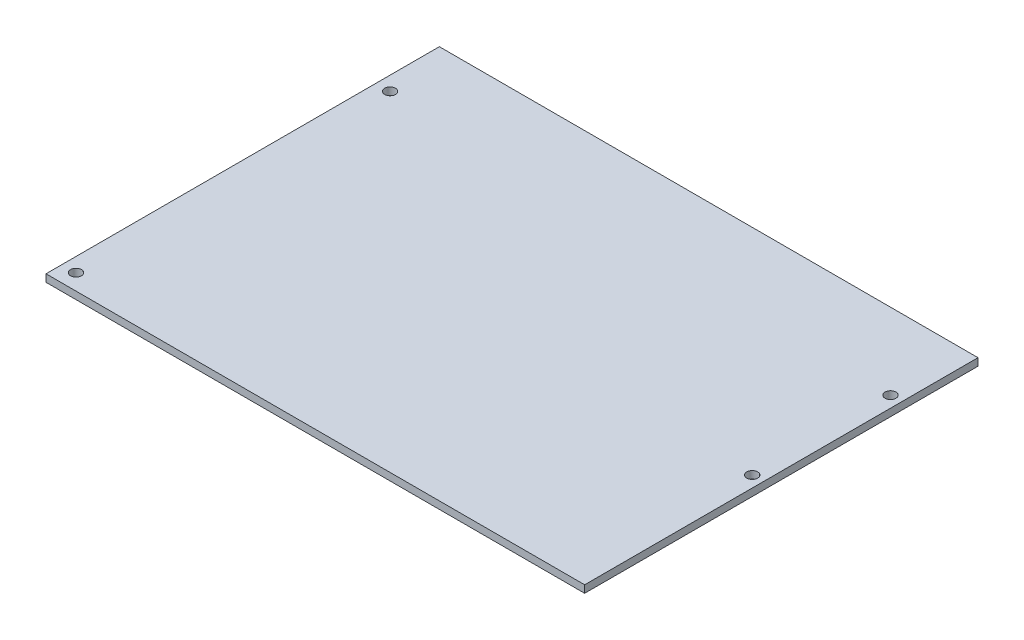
ISO-10303-21;
HEADER;
FILE_DESCRIPTION(('STEP AP214'),'2;1');
FILE_NAME('part.step','',(''),(''),'','','');
FILE_SCHEMA(('AUTOMOTIVE_DESIGN { 1 0 10303 214 1 1 1 1 }'));
ENDSEC;
DATA;
#1=APPLICATION_CONTEXT('core data for automotive mechanical design processes');
#2=APPLICATION_PROTOCOL_DEFINITION('international standard','automotive_design',2000,#1);
#3=PRODUCT_CONTEXT('',#1,'mechanical');
#4=PRODUCT('Part','Part','',(#3));
#5=PRODUCT_RELATED_PRODUCT_CATEGORY('part','',(#4));
#6=PRODUCT_DEFINITION_FORMATION('','',#4);
#7=PRODUCT_DEFINITION_CONTEXT('part definition',#1,'design');
#8=PRODUCT_DEFINITION('design','',#6,#7);
#9=PRODUCT_DEFINITION_SHAPE('','',#8);
#10=(LENGTH_UNIT() NAMED_UNIT(*) SI_UNIT(.MILLI.,.METRE.));
#11=(NAMED_UNIT(*) PLANE_ANGLE_UNIT() SI_UNIT($,.RADIAN.));
#12=(NAMED_UNIT(*) SI_UNIT($,.STERADIAN.) SOLID_ANGLE_UNIT());
#13=UNCERTAINTY_MEASURE_WITH_UNIT(LENGTH_MEASURE(1.E-05),#10,'distance_accuracy_value','');
#14=(GEOMETRIC_REPRESENTATION_CONTEXT(3) GLOBAL_UNCERTAINTY_ASSIGNED_CONTEXT((#13)) GLOBAL_UNIT_ASSIGNED_CONTEXT((#10,
#11,#12)) REPRESENTATION_CONTEXT('',''));
#15=CARTESIAN_POINT('',(0.,0.,0.));
#16=DIRECTION('',(0.,0.,1.));
#17=DIRECTION('',(1.,0.,0.));
#18=AXIS2_PLACEMENT_3D('',#15,#16,#17);
#19=CARTESIAN_POINT('',(0.,2.0066,-106.5657));
#20=DIRECTION('',(0.,-1.,0.));
#21=DIRECTION('',(0.,0.,-1.));
#22=AXIS2_PLACEMENT_3D('',#19,#20,#21);
#23=PLANE('',#22);
#24=CARTESIAN_POINT('',(142.875,2.0066,-85.9155));
#25=DIRECTION('',(0.,1.,0.));
#26=DIRECTION('',(0.,0.,1.));
#27=AXIS2_PLACEMENT_3D('',#24,#25,#26);
#28=CIRCLE('',#27,1.4732);
#29=CARTESIAN_POINT('',(142.875,2.0066,-84.4423));
#30=VERTEX_POINT('',#29);
#31=EDGE_CURVE('E123',#30,#30,#28,.T.);
#32=ORIENTED_EDGE('',*,*,#31,.F.);
#33=EDGE_LOOP('',(#32));
#34=FACE_BOUND('',#33,.T.);
#35=CARTESIAN_POINT('',(3.81,2.0066,-89.408));
#36=DIRECTION('',(0.,1.,0.));
#37=DIRECTION('',(0.,0.,1.));
#38=AXIS2_PLACEMENT_3D('',#35,#36,#37);
#39=CIRCLE('',#38,1.4732);
#40=CARTESIAN_POINT('',(3.81,2.0066,-87.9348));
#41=VERTEX_POINT('',#40);
#42=EDGE_CURVE('E91',#41,#41,#39,.T.);
#43=ORIENTED_EDGE('',*,*,#42,.F.);
#44=EDGE_LOOP('',(#43));
#45=FACE_BOUND('',#44,.T.);
#46=DIRECTION('',(0.,0.,1.));
#47=VECTOR('',#46,1.);
#48=CARTESIAN_POINT('',(0.,2.0066,0.));
#49=LINE('',#48,#47);
#50=CARTESIAN_POINT('',(0.,2.0066,-106.5657));
#51=VERTEX_POINT('',#50);
#52=CARTESIAN_POINT('',(0.,2.0066,0.));
#53=VERTEX_POINT('',#52);
#54=EDGE_CURVE('E48',#51,#53,#49,.T.);
#55=ORIENTED_EDGE('',*,*,#54,.T.);
#56=DIRECTION('',(1.,0.,0.));
#57=VECTOR('',#56,1.);
#58=CARTESIAN_POINT('',(0.,2.0066,0.));
#59=LINE('',#58,#57);
#60=CARTESIAN_POINT('',(145.9357,2.0066,0.));
#61=VERTEX_POINT('',#60);
#62=EDGE_CURVE('E93',#53,#61,#59,.T.);
#63=ORIENTED_EDGE('',*,*,#62,.T.);
#64=DIRECTION('',(0.,0.,-1.));
#65=VECTOR('',#64,1.);
#66=CARTESIAN_POINT('',(145.9357,2.0066,0.));
#67=LINE('',#66,#65);
#68=CARTESIAN_POINT('',(145.9357,2.0066,-106.5657));
#69=VERTEX_POINT('',#68);
#70=EDGE_CURVE('E55',#61,#69,#67,.T.);
#71=ORIENTED_EDGE('',*,*,#70,.T.);
#72=DIRECTION('',(-1.,0.,0.));
#73=VECTOR('',#72,1.);
#74=CARTESIAN_POINT('',(0.,2.0066,-106.5657));
#75=LINE('',#74,#73);
#76=EDGE_CURVE('E97',#69,#51,#75,.T.);
#77=ORIENTED_EDGE('',*,*,#76,.T.);
#78=EDGE_LOOP('',(#55,#63,#71,#77));
#79=FACE_BOUND('',#78,.T.);
#80=CARTESIAN_POINT('',(3.81,2.0066,-4.318));
#81=DIRECTION('',(0.,1.,0.));
#82=DIRECTION('',(0.,0.,1.));
#83=AXIS2_PLACEMENT_3D('',#80,#81,#82);
#84=CIRCLE('',#83,1.4732);
#85=CARTESIAN_POINT('',(3.81,2.0066,-2.8448));
#86=VERTEX_POINT('',#85);
#87=EDGE_CURVE('E117',#86,#86,#84,.T.);
#88=ORIENTED_EDGE('',*,*,#87,.F.);
#89=EDGE_LOOP('',(#88));
#90=FACE_BOUND('',#89,.T.);
#91=CARTESIAN_POINT('',(142.875,2.0066,-48.4505));
#92=DIRECTION('',(0.,1.,0.));
#93=DIRECTION('',(0.,0.,1.));
#94=AXIS2_PLACEMENT_3D('',#91,#92,#93);
#95=CIRCLE('',#94,1.4732);
#96=CARTESIAN_POINT('',(142.875,2.0066,-46.9773));
#97=VERTEX_POINT('',#96);
#98=EDGE_CURVE('E129',#97,#97,#95,.T.);
#99=ORIENTED_EDGE('',*,*,#98,.F.);
#100=EDGE_LOOP('',(#99));
#101=FACE_BOUND('',#100,.T.);
#102=ADVANCED_FACE('F33',(#34,#45,#79,#90,#101),#23,.F.);
#103=CARTESIAN_POINT('',(0.,0.,-106.5657));
#104=DIRECTION('',(0.,-1.,0.));
#105=DIRECTION('',(0.,0.,-1.));
#106=AXIS2_PLACEMENT_3D('',#103,#104,#105);
#107=PLANE('',#106);
#108=CARTESIAN_POINT('',(142.875,0.,-85.9155));
#109=DIRECTION('',(0.,1.,0.));
#110=DIRECTION('',(0.,0.,1.));
#111=AXIS2_PLACEMENT_3D('',#108,#109,#110);
#112=CIRCLE('',#111,1.4732);
#113=CARTESIAN_POINT('',(142.875,0.,-84.4423));
#114=VERTEX_POINT('',#113);
#115=EDGE_CURVE('E126',#114,#114,#112,.T.);
#116=ORIENTED_EDGE('',*,*,#115,.T.);
#117=EDGE_LOOP('',(#116));
#118=FACE_BOUND('',#117,.T.);
#119=CARTESIAN_POINT('',(3.81,0.,-89.408));
#120=DIRECTION('',(0.,1.,0.));
#121=DIRECTION('',(0.,0.,1.));
#122=AXIS2_PLACEMENT_3D('',#119,#120,#121);
#123=CIRCLE('',#122,1.4732);
#124=CARTESIAN_POINT('',(3.81,0.,-87.9348));
#125=VERTEX_POINT('',#124);
#126=EDGE_CURVE('E114',#125,#125,#123,.T.);
#127=ORIENTED_EDGE('',*,*,#126,.T.);
#128=EDGE_LOOP('',(#127));
#129=FACE_BOUND('',#128,.T.);
#130=DIRECTION('',(1.,0.,0.));
#131=VECTOR('',#130,1.);
#132=CARTESIAN_POINT('',(0.,0.,0.));
#133=LINE('',#132,#131);
#134=CARTESIAN_POINT('',(0.,0.,0.));
#135=VERTEX_POINT('',#134);
#136=CARTESIAN_POINT('',(145.9357,0.,0.));
#137=VERTEX_POINT('',#136);
#138=EDGE_CURVE('E84',#135,#137,#133,.T.);
#139=ORIENTED_EDGE('',*,*,#138,.F.);
#140=DIRECTION('',(0.,0.,1.));
#141=VECTOR('',#140,1.);
#142=CARTESIAN_POINT('',(0.,0.,-92.5957));
#143=LINE('',#142,#141);
#144=CARTESIAN_POINT('',(0.,0.,-106.5657));
#145=VERTEX_POINT('',#144);
#146=EDGE_CURVE('E74',#145,#135,#143,.T.);
#147=ORIENTED_EDGE('',*,*,#146,.F.);
#148=DIRECTION('',(-1.,0.,0.));
#149=VECTOR('',#148,1.);
#150=CARTESIAN_POINT('',(0.,0.,-106.5657));
#151=LINE('',#150,#149);
#152=CARTESIAN_POINT('',(145.9357,0.,-106.5657));
#153=VERTEX_POINT('',#152);
#154=EDGE_CURVE('E81',#153,#145,#151,.T.);
#155=ORIENTED_EDGE('',*,*,#154,.F.);
#156=DIRECTION('',(0.,0.,-1.));
#157=VECTOR('',#156,1.);
#158=CARTESIAN_POINT('',(145.9357,0.,-106.5657));
#159=LINE('',#158,#157);
#160=EDGE_CURVE('E87',#137,#153,#159,.T.);
#161=ORIENTED_EDGE('',*,*,#160,.F.);
#162=EDGE_LOOP('',(#139,#147,#155,#161));
#163=FACE_BOUND('',#162,.T.);
#164=CARTESIAN_POINT('',(3.81,0.,-4.318));
#165=DIRECTION('',(0.,1.,0.));
#166=DIRECTION('',(0.,0.,1.));
#167=AXIS2_PLACEMENT_3D('',#164,#165,#166);
#168=CIRCLE('',#167,1.4732);
#169=CARTESIAN_POINT('',(3.81,0.,-2.8448));
#170=VERTEX_POINT('',#169);
#171=EDGE_CURVE('E120',#170,#170,#168,.T.);
#172=ORIENTED_EDGE('',*,*,#171,.T.);
#173=EDGE_LOOP('',(#172));
#174=FACE_BOUND('',#173,.T.);
#175=CARTESIAN_POINT('',(142.875,0.,-48.4505));
#176=DIRECTION('',(0.,1.,0.));
#177=DIRECTION('',(0.,0.,1.));
#178=AXIS2_PLACEMENT_3D('',#175,#176,#177);
#179=CIRCLE('',#178,1.4732);
#180=CARTESIAN_POINT('',(142.875,0.,-46.9773));
#181=VERTEX_POINT('',#180);
#182=EDGE_CURVE('E132',#181,#181,#179,.T.);
#183=ORIENTED_EDGE('',*,*,#182,.T.);
#184=EDGE_LOOP('',(#183));
#185=FACE_BOUND('',#184,.T.);
#186=ADVANCED_FACE('F85',(#118,#129,#163,#174,#185),#107,.T.);
#187=CARTESIAN_POINT('',(0.,2.0066,0.));
#188=DIRECTION('',(0.,0.,-1.));
#189=DIRECTION('',(-1.,0.,0.));
#190=AXIS2_PLACEMENT_3D('',#187,#188,#189);
#191=PLANE('',#190);
#192=ORIENTED_EDGE('',*,*,#138,.T.);
#193=DIRECTION('',(0.,-1.,0.));
#194=VECTOR('',#193,1.);
#195=CARTESIAN_POINT('',(145.9357,2.0066,0.));
#196=LINE('',#195,#194);
#197=EDGE_CURVE('E41',#61,#137,#196,.T.);
#198=ORIENTED_EDGE('',*,*,#197,.F.);
#199=ORIENTED_EDGE('',*,*,#62,.F.);
#200=DIRECTION('',(0.,-1.,0.));
#201=VECTOR('',#200,1.);
#202=CARTESIAN_POINT('',(0.,2.0066,0.));
#203=LINE('',#202,#201);
#204=EDGE_CURVE('E11',#53,#135,#203,.T.);
#205=ORIENTED_EDGE('',*,*,#204,.T.);
#206=EDGE_LOOP('',(#192,#198,#199,#205));
#207=FACE_BOUND('',#206,.T.);
#208=ADVANCED_FACE('F35',(#207),#191,.F.);
#209=CARTESIAN_POINT('',(145.9357,2.0066,-106.5657));
#210=DIRECTION('',(-1.,0.,0.));
#211=DIRECTION('',(0.,0.,1.));
#212=AXIS2_PLACEMENT_3D('',#209,#210,#211);
#213=PLANE('',#212);
#214=ORIENTED_EDGE('',*,*,#160,.T.);
#215=DIRECTION('',(0.,-1.,0.));
#216=VECTOR('',#215,1.);
#217=CARTESIAN_POINT('',(145.9357,2.0066,-106.5657));
#218=LINE('',#217,#216);
#219=EDGE_CURVE('E104',#69,#153,#218,.T.);
#220=ORIENTED_EDGE('',*,*,#219,.F.);
#221=ORIENTED_EDGE('',*,*,#70,.F.);
#222=ORIENTED_EDGE('',*,*,#197,.T.);
#223=EDGE_LOOP('',(#214,#220,#221,#222));
#224=FACE_BOUND('',#223,.T.);
#225=ADVANCED_FACE('F107',(#224),#213,.F.);
#226=CARTESIAN_POINT('',(0.,2.0066,-106.5657));
#227=DIRECTION('',(0.,0.,1.));
#228=DIRECTION('',(1.,0.,0.));
#229=AXIS2_PLACEMENT_3D('',#226,#227,#228);
#230=PLANE('',#229);
#231=ORIENTED_EDGE('',*,*,#154,.T.);
#232=DIRECTION('',(0.,-1.,0.));
#233=VECTOR('',#232,1.);
#234=CARTESIAN_POINT('',(0.,2.0066,-106.5657));
#235=LINE('',#234,#233);
#236=EDGE_CURVE('E78',#51,#145,#235,.T.);
#237=ORIENTED_EDGE('',*,*,#236,.F.);
#238=ORIENTED_EDGE('',*,*,#76,.F.);
#239=ORIENTED_EDGE('',*,*,#219,.T.);
#240=EDGE_LOOP('',(#231,#237,#238,#239));
#241=FACE_BOUND('',#240,.T.);
#242=ADVANCED_FACE('F109',(#241),#230,.F.);
#243=CARTESIAN_POINT('',(0.,2.0066,-92.5957));
#244=DIRECTION('',(1.,0.,0.));
#245=DIRECTION('',(0.,0.,-1.));
#246=AXIS2_PLACEMENT_3D('',#243,#244,#245);
#247=PLANE('',#246);
#248=ORIENTED_EDGE('',*,*,#146,.T.);
#249=ORIENTED_EDGE('',*,*,#204,.F.);
#250=ORIENTED_EDGE('',*,*,#54,.F.);
#251=ORIENTED_EDGE('',*,*,#236,.T.);
#252=EDGE_LOOP('',(#248,#249,#250,#251));
#253=FACE_BOUND('',#252,.T.);
#254=ADVANCED_FACE('F76',(#253),#247,.F.);
#255=CARTESIAN_POINT('',(3.81,2.0066,-89.408));
#256=DIRECTION('',(0.,-1.,0.));
#257=DIRECTION('',(0.,0.,-1.));
#258=AXIS2_PLACEMENT_3D('',#255,#256,#257);
#259=CYLINDRICAL_SURFACE('',#258,1.4732);
#260=ORIENTED_EDGE('',*,*,#42,.T.);
#261=EDGE_LOOP('',(#260));
#262=FACE_BOUND('',#261,.T.);
#263=ORIENTED_EDGE('',*,*,#126,.F.);
#264=EDGE_LOOP('',(#263));
#265=FACE_BOUND('',#264,.T.);
#266=ADVANCED_FACE('F162',(#262,#265),#259,.F.);
#267=CARTESIAN_POINT('',(3.81,2.0066,-4.318));
#268=DIRECTION('',(0.,-1.,0.));
#269=DIRECTION('',(0.,0.,-1.));
#270=AXIS2_PLACEMENT_3D('',#267,#268,#269);
#271=CYLINDRICAL_SURFACE('',#270,1.4732);
#272=ORIENTED_EDGE('',*,*,#87,.T.);
#273=EDGE_LOOP('',(#272));
#274=FACE_BOUND('',#273,.T.);
#275=ORIENTED_EDGE('',*,*,#171,.F.);
#276=EDGE_LOOP('',(#275));
#277=FACE_BOUND('',#276,.T.);
#278=ADVANCED_FACE('F145',(#274,#277),#271,.F.);
#279=CARTESIAN_POINT('',(142.875,2.0066,-85.9155));
#280=DIRECTION('',(0.,-1.,0.));
#281=DIRECTION('',(0.,0.,-1.));
#282=AXIS2_PLACEMENT_3D('',#279,#280,#281);
#283=CYLINDRICAL_SURFACE('',#282,1.4732);
#284=ORIENTED_EDGE('',*,*,#31,.T.);
#285=EDGE_LOOP('',(#284));
#286=FACE_BOUND('',#285,.T.);
#287=ORIENTED_EDGE('',*,*,#115,.F.);
#288=EDGE_LOOP('',(#287));
#289=FACE_BOUND('',#288,.T.);
#290=ADVANCED_FACE('F139',(#286,#289),#283,.F.);
#291=CARTESIAN_POINT('',(142.875,2.0066,-48.4505));
#292=DIRECTION('',(0.,-1.,0.));
#293=DIRECTION('',(0.,0.,-1.));
#294=AXIS2_PLACEMENT_3D('',#291,#292,#293);
#295=CYLINDRICAL_SURFACE('',#294,1.4732);
#296=ORIENTED_EDGE('',*,*,#98,.T.);
#297=EDGE_LOOP('',(#296));
#298=FACE_BOUND('',#297,.T.);
#299=ORIENTED_EDGE('',*,*,#182,.F.);
#300=EDGE_LOOP('',(#299));
#301=FACE_BOUND('',#300,.T.);
#302=ADVANCED_FACE('F137',(#298,#301),#295,.F.);
#303=CLOSED_SHELL('',(#102,#186,#208,#225,#242,#254,#266,#278,#290,#302));
#304=MANIFOLD_SOLID_BREP('B2',#303);
#305=ADVANCED_BREP_SHAPE_REPRESENTATION('',(#18,#304),#14);
#306=SHAPE_DEFINITION_REPRESENTATION(#9,#305);
ENDSEC;
END-ISO-10303-21;
